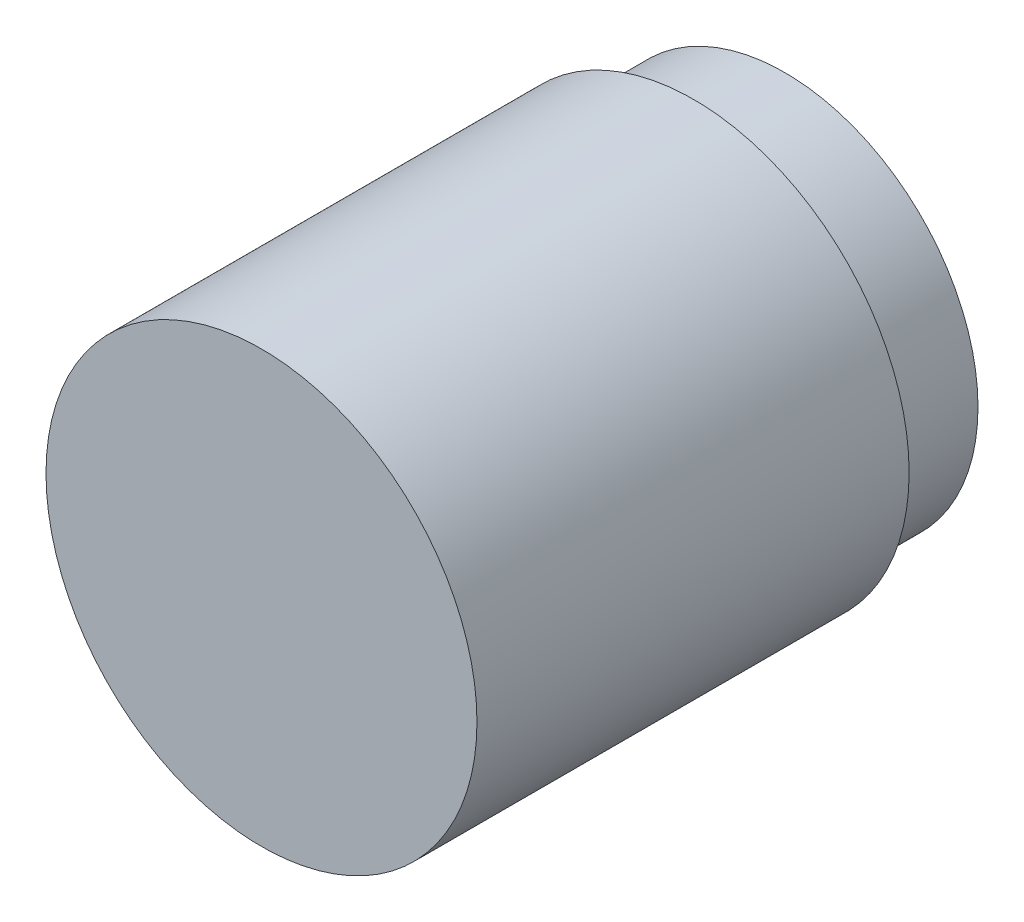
from build123d import *

# Parameters (mm, degrees)
SKETCH1_R      = 14.85
EXTRUDE1_DEPTH = 36.068
SKETCH2_W      = 1.54
SKETCH2_H      = 6.2865


with BuildPart() as part:
    # Sketch1 → Extrude1 (new body)
    with BuildSketch(Plane.XY):
        with Locations(Location((0, 0, 0), (0, 0, 180))):
            Circle(SKETCH1_R)
    extrude(amount=EXTRUDE1_DEPTH)

    # Sketch2 → Cut-Revolve1 (revolve, cut)
    with BuildSketch(Plane(origin=(0, 0, 0), x_dir=(1, 0, 0), z_dir=(0, 1, 0)), mode=Mode.PRIVATE) as cut_revolve1_sk:
        with Locations((14.08, -3.14325)):
            Rectangle(SKETCH2_W, SKETCH2_H)
    revolve(cut_revolve1_sk.sketch.rotate(Axis((0, 0, 0), (0, 0, 1)), 180), axis=Axis((0, 0, 0), (0, 0, 1)), mode=Mode.SUBTRACT)


solid = part.part
